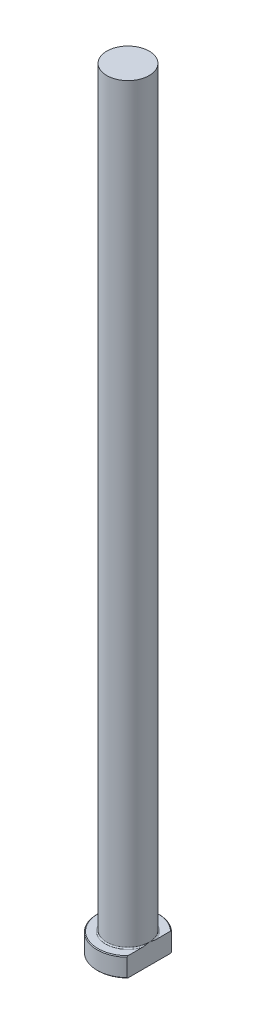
ISO-10303-21;
HEADER;
FILE_DESCRIPTION(('STEP AP214'),'2;1');
FILE_NAME('part.step','',(''),(''),'','','');
FILE_SCHEMA(('AUTOMOTIVE_DESIGN { 1 0 10303 214 1 1 1 1 }'));
ENDSEC;
DATA;
#1=APPLICATION_CONTEXT('core data for automotive mechanical design processes');
#2=APPLICATION_PROTOCOL_DEFINITION('international standard','automotive_design',2000,#1);
#3=PRODUCT_CONTEXT('',#1,'mechanical');
#4=PRODUCT('Part','Part','',(#3));
#5=PRODUCT_RELATED_PRODUCT_CATEGORY('part','',(#4));
#6=PRODUCT_DEFINITION_FORMATION('','',#4);
#7=PRODUCT_DEFINITION_CONTEXT('part definition',#1,'design');
#8=PRODUCT_DEFINITION('design','',#6,#7);
#9=PRODUCT_DEFINITION_SHAPE('','',#8);
#10=(LENGTH_UNIT() NAMED_UNIT(*) SI_UNIT(.MILLI.,.METRE.));
#11=(NAMED_UNIT(*) PLANE_ANGLE_UNIT() SI_UNIT($,.RADIAN.));
#12=(NAMED_UNIT(*) SI_UNIT($,.STERADIAN.) SOLID_ANGLE_UNIT());
#13=UNCERTAINTY_MEASURE_WITH_UNIT(LENGTH_MEASURE(1.E-05),#10,'distance_accuracy_value','');
#14=(GEOMETRIC_REPRESENTATION_CONTEXT(3) GLOBAL_UNCERTAINTY_ASSIGNED_CONTEXT((#13)) GLOBAL_UNIT_ASSIGNED_CONTEXT((#10,
#11,#12)) REPRESENTATION_CONTEXT('',''));
#15=CARTESIAN_POINT('',(0.,0.,0.));
#16=DIRECTION('',(0.,0.,1.));
#17=DIRECTION('',(1.,0.,0.));
#18=AXIS2_PLACEMENT_3D('',#15,#16,#17);
#19=CARTESIAN_POINT('',(0.,0.,0.));
#20=DIRECTION('',(0.,-1.,0.));
#21=DIRECTION('',(0.,0.,-1.));
#22=AXIS2_PLACEMENT_3D('',#19,#20,#21);
#23=PLANE('',#22);
#24=CARTESIAN_POINT('',(0.,0.,0.));
#25=DIRECTION('',(0.,-1.,0.));
#26=DIRECTION('',(0.,0.,-1.));
#27=AXIS2_PLACEMENT_3D('',#24,#25,#26);
#28=CIRCLE('',#27,7.79999999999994);
#29=CARTESIAN_POINT('',(5.49999999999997,0.,5.53082272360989));
#30=VERTEX_POINT('',#29);
#31=CARTESIAN_POINT('',(5.49999999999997,0.,-5.53082272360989));
#32=VERTEX_POINT('',#31);
#33=EDGE_CURVE('E98',#30,#32,#28,.T.);
#34=ORIENTED_EDGE('',*,*,#33,.T.);
#35=DIRECTION('',(0.,0.,1.));
#36=VECTOR('',#35,1.);
#37=CARTESIAN_POINT('',(5.49999999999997,0.,-5.80947501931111));
#38=LINE('',#37,#36);
#39=EDGE_CURVE('E83',#32,#30,#38,.T.);
#40=ORIENTED_EDGE('',*,*,#39,.T.);
#41=EDGE_LOOP('',(#34,#40));
#42=FACE_BOUND('',#41,.T.);
#43=ADVANCED_FACE('F32',(#42),#23,.T.);
#44=CARTESIAN_POINT('',(0.,259.958771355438,0.));
#45=DIRECTION('',(0.,1.,0.));
#46=DIRECTION('',(0.,0.,1.));
#47=AXIS2_PLACEMENT_3D('',#44,#45,#46);
#48=CYLINDRICAL_SURFACE('',#47,7.99999999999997);
#49=CARTESIAN_POINT('',(0.,4.80000000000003,0.));
#50=DIRECTION('',(0.,1.,0.));
#51=DIRECTION('',(0.,0.,1.));
#52=AXIS2_PLACEMENT_3D('',#49,#50,#51);
#53=CIRCLE('',#52,7.99999999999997);
#54=CARTESIAN_POINT('',(5.49999999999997,4.80000000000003,5.80947501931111));
#55=VERTEX_POINT('',#54);
#56=CARTESIAN_POINT('',(5.49999999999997,4.80000000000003,-5.80947501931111));
#57=VERTEX_POINT('',#56);
#58=EDGE_CURVE('E104',#55,#57,#53,.F.);
#59=ORIENTED_EDGE('',*,*,#58,.T.);
#60=DIRECTION('',(0.,-1.,0.));
#61=VECTOR('',#60,1.);
#62=CARTESIAN_POINT('',(5.49999999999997,200.,-5.80947501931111));
#63=LINE('',#62,#61);
#64=CARTESIAN_POINT('',(5.49999999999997,0.200000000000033,-5.80947501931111));
#65=VERTEX_POINT('',#64);
#66=EDGE_CURVE('E183',#57,#65,#63,.T.);
#67=ORIENTED_EDGE('',*,*,#66,.T.);
#68=CARTESIAN_POINT('',(0.,0.200000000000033,0.));
#69=DIRECTION('',(0.,-1.,0.));
#70=DIRECTION('',(0.,0.,-1.));
#71=AXIS2_PLACEMENT_3D('',#68,#69,#70);
#72=CIRCLE('',#71,7.99999999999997);
#73=CARTESIAN_POINT('',(5.49999999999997,0.200000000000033,5.80947501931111));
#74=VERTEX_POINT('',#73);
#75=EDGE_CURVE('E100',#65,#74,#72,.F.);
#76=ORIENTED_EDGE('',*,*,#75,.T.);
#77=DIRECTION('',(0.,-1.,0.));
#78=VECTOR('',#77,1.);
#79=CARTESIAN_POINT('',(5.49999999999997,200.,5.80947501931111));
#80=LINE('',#79,#78);
#81=EDGE_CURVE('E93',#55,#74,#80,.T.);
#82=ORIENTED_EDGE('',*,*,#81,.F.);
#83=EDGE_LOOP('',(#59,#67,#76,#82));
#84=FACE_BOUND('',#83,.T.);
#85=ADVANCED_FACE('F158',(#84),#48,.T.);
#86=CARTESIAN_POINT('',(-7.99999999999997,5.,0.));
#87=DIRECTION('',(0.,1.,0.));
#88=DIRECTION('',(0.,0.,1.));
#89=AXIS2_PLACEMENT_3D('',#86,#87,#88);
#90=PLANE('',#89);
#91=CARTESIAN_POINT('',(0.,5.,0.));
#92=DIRECTION('',(0.,1.,0.));
#93=DIRECTION('',(0.,0.,1.));
#94=AXIS2_PLACEMENT_3D('',#91,#92,#93);
#95=CIRCLE('',#94,7.79999999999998);
#96=CARTESIAN_POINT('',(5.49999999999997,5.,-5.53082272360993));
#97=VERTEX_POINT('',#96);
#98=CARTESIAN_POINT('',(5.49999999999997,5.,5.53082272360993));
#99=VERTEX_POINT('',#98);
#100=EDGE_CURVE('E178',#97,#99,#95,.T.);
#101=ORIENTED_EDGE('',*,*,#100,.T.);
#102=DIRECTION('',(0.,0.,-1.));
#103=VECTOR('',#102,1.);
#104=CARTESIAN_POINT('',(5.49999999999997,5.,0.));
#105=LINE('',#104,#103);
#106=CARTESIAN_POINT('',(5.49999999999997,4.99999999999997,1.84119526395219));
#107=VERTEX_POINT('',#106);
#108=EDGE_CURVE('E57',#99,#107,#105,.T.);
#109=ORIENTED_EDGE('',*,*,#108,.T.);
#110=CARTESIAN_POINT('',(0.,5.,0.));
#111=DIRECTION('',(0.,1.,0.));
#112=DIRECTION('',(0.,0.,1.));
#113=AXIS2_PLACEMENT_3D('',#110,#111,#112);
#114=CIRCLE('',#113,5.79999999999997);
#115=CARTESIAN_POINT('',(5.49999999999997,4.99999999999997,-1.84119526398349));
#116=VERTEX_POINT('',#115);
#117=EDGE_CURVE('E107',#107,#116,#114,.F.);
#118=ORIENTED_EDGE('',*,*,#117,.T.);
#119=EDGE_CURVE('E136',#116,#97,#105,.T.);
#120=ORIENTED_EDGE('',*,*,#119,.T.);
#121=EDGE_LOOP('',(#101,#109,#118,#120));
#122=FACE_BOUND('',#121,.T.);
#123=ADVANCED_FACE('F147',(#122),#90,.T.);
#124=CARTESIAN_POINT('',(0.,5.,0.));
#125=DIRECTION('',(0.,-1.,0.));
#126=DIRECTION('',(0.,0.,-1.));
#127=AXIS2_PLACEMENT_3D('',#124,#125,#126);
#128=CONICAL_SURFACE('',#127,7.79999999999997,0.785398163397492);
#129=ORIENTED_EDGE('',*,*,#58,.F.);
#130=CARTESIAN_POINT('',(5.49999999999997,-1.11515403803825,12.7820777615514));
#131=CARTESIAN_POINT('',(5.49999999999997,-0.94151788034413,12.5930460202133));
#132=CARTESIAN_POINT('',(5.49999999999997,-0.768204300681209,12.4037180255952));
#133=CARTESIAN_POINT('',(5.49999999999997,-0.422318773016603,12.0243831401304));
#134=CARTESIAN_POINT('',(5.49999999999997,-0.249746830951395,11.8343762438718));
#135=CARTESIAN_POINT('',(5.49999999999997,0.266785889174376,11.2631256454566));
#136=CARTESIAN_POINT('',(5.49999999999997,0.609484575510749,10.8807378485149));
#137=CARTESIAN_POINT('',(5.49999999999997,1.29256544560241,10.1095655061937));
#138=CARTESIAN_POINT('',(5.49999999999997,1.63291928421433,9.72075580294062));
#139=CARTESIAN_POINT('',(5.49999999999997,2.30738282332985,8.9378216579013));
#140=CARTESIAN_POINT('',(5.49999999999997,2.64149328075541,8.54369787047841));
#141=CARTESIAN_POINT('',(5.49999999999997,3.24251408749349,7.81851180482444));
#142=CARTESIAN_POINT('',(5.49999999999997,3.51085021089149,7.48863708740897));
#143=CARTESIAN_POINT('',(5.49999999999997,3.90712731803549,6.98880713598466));
#144=CARTESIAN_POINT('',(5.49999999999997,4.03820076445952,6.82133570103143));
#145=CARTESIAN_POINT('',(5.49999999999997,4.29784042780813,6.48446279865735));
#146=CARTESIAN_POINT('',(5.49999999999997,4.42640670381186,6.31506137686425));
#147=CARTESIAN_POINT('',(5.49999999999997,4.68038690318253,5.97419641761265));
#148=CARTESIAN_POINT('',(5.49999999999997,4.80580413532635,5.80273535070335));
#149=CARTESIAN_POINT('',(5.49999999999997,5.05297330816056,5.4571974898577));
#150=CARTESIAN_POINT('',(5.49999999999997,5.17472543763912,5.2831208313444));
#151=CARTESIAN_POINT('',(5.49999999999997,5.41367984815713,4.93196486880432));
#152=CARTESIAN_POINT('',(5.49999999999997,5.53088395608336,4.75488681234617));
#153=CARTESIAN_POINT('',(5.49999999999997,5.7596825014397,4.3971560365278));
#154=CARTESIAN_POINT('',(5.49999999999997,5.87127761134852,4.21650374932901));
#155=CARTESIAN_POINT('',(5.49999999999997,6.08629942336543,3.85292662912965));
#156=CARTESIAN_POINT('',(5.49999999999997,6.18979942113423,3.67004539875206));
#157=CARTESIAN_POINT('',(5.49999999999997,6.38808999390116,3.29955746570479));
#158=CARTESIAN_POINT('',(5.49999999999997,6.48287965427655,3.11195026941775));
#159=CARTESIAN_POINT('',(5.49999999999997,6.66127167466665,2.7316929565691));
#160=CARTESIAN_POINT('',(5.49999999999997,6.7448862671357,2.53904863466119));
#161=CARTESIAN_POINT('',(5.49999999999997,6.89808375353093,2.14822839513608));
#162=CARTESIAN_POINT('',(5.49999999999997,6.96767069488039,1.95005409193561));
#163=CARTESIAN_POINT('',(5.49999999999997,7.07670147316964,1.59030424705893));
#164=CARTESIAN_POINT('',(5.49999999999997,7.11940527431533,1.42972239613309));
#165=CARTESIAN_POINT('',(5.49999999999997,7.19217730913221,1.10570020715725));
#166=CARTESIAN_POINT('',(5.49999999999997,7.22224726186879,0.94226026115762));
#167=CARTESIAN_POINT('',(5.49999999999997,7.26823317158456,0.613832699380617));
#168=CARTESIAN_POINT('',(5.49999999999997,7.28418798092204,0.448850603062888));
#169=CARTESIAN_POINT('',(5.49999999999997,7.30121051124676,0.118111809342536));
#170=CARTESIAN_POINT('',(5.49999999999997,7.30227865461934,-0.0476448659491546));
#171=CARTESIAN_POINT('',(5.49999999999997,7.28946437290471,-0.378643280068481));
#172=CARTESIAN_POINT('',(5.49999999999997,7.27557532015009,-0.54388475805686));
#173=CARTESIAN_POINT('',(5.49999999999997,7.23360586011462,-0.872541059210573));
#174=CARTESIAN_POINT('',(5.49999999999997,7.20552424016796,-1.03595572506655));
#175=CARTESIAN_POINT('',(5.49999999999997,7.13645491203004,-1.36050703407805));
#176=CARTESIAN_POINT('',(5.49999999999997,7.09542895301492,-1.52163542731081));
#177=CARTESIAN_POINT('',(5.49999999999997,7.00220098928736,-1.84058362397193));
#178=CARTESIAN_POINT('',(5.49999999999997,6.94999898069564,-1.99840342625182));
#179=CARTESIAN_POINT('',(5.49999999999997,6.82412729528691,-2.34351289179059));
#180=CARTESIAN_POINT('',(5.49999999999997,6.74825204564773,-2.52999311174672));
#181=CARTESIAN_POINT('',(5.49999999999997,6.58537605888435,-2.89807095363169));
#182=CARTESIAN_POINT('',(5.49999999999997,6.4983700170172,-3.07966619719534));
#183=CARTESIAN_POINT('',(5.49999999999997,6.31536700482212,-3.43865575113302));
#184=CARTESIAN_POINT('',(5.49999999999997,6.21935375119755,-3.61604169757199));
#185=CARTESIAN_POINT('',(5.49999999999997,6.02029718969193,-3.96676299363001));
#186=CARTESIAN_POINT('',(5.49999999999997,5.91725492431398,-4.14009893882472));
#187=CARTESIAN_POINT('',(5.49999999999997,5.70428964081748,-4.4852832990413));
#188=CARTESIAN_POINT('',(5.49999999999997,5.59430018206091,-4.65709053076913));
#189=CARTESIAN_POINT('',(5.49999999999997,5.3696632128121,-4.99762683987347));
#190=CARTESIAN_POINT('',(5.49999999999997,5.25501557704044,-5.16635583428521));
#191=CARTESIAN_POINT('',(5.49999999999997,5.02205528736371,-5.50098485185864));
#192=CARTESIAN_POINT('',(5.49999999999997,4.90374674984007,-5.66688774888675));
#193=CARTESIAN_POINT('',(5.49999999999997,4.66400808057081,-5.9964258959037));
#194=CARTESIAN_POINT('',(5.49999999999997,4.54257783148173,-6.16006106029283));
#195=CARTESIAN_POINT('',(5.49999999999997,4.20154795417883,-6.61207712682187));
#196=CARTESIAN_POINT('',(5.49999999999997,3.97915323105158,-6.89834873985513));
#197=CARTESIAN_POINT('',(5.49999999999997,3.52835863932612,-7.46612572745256));
#198=CARTESIAN_POINT('',(5.49999999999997,3.29995838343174,-7.7476307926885));
#199=CARTESIAN_POINT('',(5.49999999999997,2.83846100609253,-8.30706072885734));
#200=CARTESIAN_POINT('',(5.49999999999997,2.6053609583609,-8.58498318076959));
#201=CARTESIAN_POINT('',(5.49999999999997,2.13563301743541,-9.13783071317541));
#202=CARTESIAN_POINT('',(5.49999999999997,1.89900507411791,-9.41275575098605));
#203=CARTESIAN_POINT('',(5.49999999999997,1.43345389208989,-9.94811769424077));
#204=CARTESIAN_POINT('',(5.49999999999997,1.2046506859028,-10.2086591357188));
#205=CARTESIAN_POINT('',(5.49999999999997,0.744976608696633,-10.7279148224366));
#206=CARTESIAN_POINT('',(5.49999999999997,0.514105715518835,-10.9866290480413));
#207=CARTESIAN_POINT('',(5.49999999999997,0.0509694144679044,-11.5022006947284));
#208=CARTESIAN_POINT('',(5.49999999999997,-0.181293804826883,-11.7590600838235));
#209=CARTESIAN_POINT('',(5.49999999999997,-0.647231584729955,-12.2714820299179));
#210=CARTESIAN_POINT('',(5.49999999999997,-0.880906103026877,-12.5270446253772));
#211=CARTESIAN_POINT('',(5.49999999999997,-1.11515403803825,-12.7820777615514));
#212=B_SPLINE_CURVE_WITH_KNOTS('',3,(#130,#131,#132,#133,#134,#135,#136,#137,#138,#139,#140,
#141,#142,#143,#144,#145,#146,#147,#148,#149,#150,#151,#152,#153,#154,#155,#156,#157,#158,#159,
#160,#161,#162,#163,#164,#165,#166,#167,#168,#169,#170,#171,#172,#173,#174,#175,#176,#177,#178,
#179,#180,#181,#182,#183,#184,#185,#186,#187,#188,#189,#190,#191,#192,#193,#194,#195,#196,#197,
#198,#199,#200,#201,#202,#203,#204,#205,#206,#207,#208,#209,#210,#211),.UNSPECIFIED.,.F.,.F.,(4,
2,2,2,2,2,2,2,2,2,2,2,2,2,2,2,2,2,2,2,2,2,2,2,2,2,2,2,2,2,2,2,2,2,2,2,2,2,2,2,4),(0.,
0.770026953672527,1.54006005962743,3.080476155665,4.63063153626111,6.18059774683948,
7.45618053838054,8.09416066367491,8.73212573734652,9.36938977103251,10.006620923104,
10.6435933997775,11.2804893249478,11.9107163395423,12.5410094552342,13.1706068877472,
13.800022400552,14.2980757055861,14.7960612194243,15.2926717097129,15.7892681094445,
16.2860846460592,16.782943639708,17.2812848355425,17.7796262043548,18.3831348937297,
18.9869322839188,19.5918430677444,20.1966643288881,20.8085675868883,21.4204873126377,
22.031742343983,22.6430203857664,23.7304168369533,24.8178835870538,25.9060497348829,
26.99423135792,28.0344561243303,29.0746920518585,30.1135832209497,31.1524433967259),.UNSPECIFIED.);
#213=EDGE_CURVE('E135',#55,#99,#212,.T.);
#214=ORIENTED_EDGE('',*,*,#213,.T.);
#215=ORIENTED_EDGE('',*,*,#100,.F.);
#216=EDGE_CURVE('E127',#97,#57,#212,.T.);
#217=ORIENTED_EDGE('',*,*,#216,.T.);
#218=EDGE_LOOP('',(#129,#214,#215,#217));
#219=FACE_BOUND('',#218,.T.);
#220=ADVANCED_FACE('F143',(#219),#128,.T.);
#221=CARTESIAN_POINT('',(0.,0.200000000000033,0.));
#222=DIRECTION('',(0.,1.,0.));
#223=DIRECTION('',(0.,0.,1.));
#224=AXIS2_PLACEMENT_3D('',#221,#222,#223);
#225=CONICAL_SURFACE('',#224,7.99999999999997,0.785398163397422);
#226=ORIENTED_EDGE('',*,*,#75,.F.);
#227=CARTESIAN_POINT('',(5.49999999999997,6.11515403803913,-12.7820777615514));
#228=CARTESIAN_POINT('',(5.49999999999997,5.941517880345,-12.5930460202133));
#229=CARTESIAN_POINT('',(5.49999999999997,5.76820430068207,-12.4037180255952));
#230=CARTESIAN_POINT('',(5.49999999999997,5.42231877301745,-12.0243831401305));
#231=CARTESIAN_POINT('',(5.49999999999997,5.24974683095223,-11.8343762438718));
#232=CARTESIAN_POINT('',(5.49999999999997,4.73321411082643,-11.2631256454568));
#233=CARTESIAN_POINT('',(5.49999999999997,4.39051542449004,-10.8807378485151));
#234=CARTESIAN_POINT('',(5.49999999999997,3.70743455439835,-10.109565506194));
#235=CARTESIAN_POINT('',(5.49999999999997,3.36708071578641,-9.7207558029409));
#236=CARTESIAN_POINT('',(5.49999999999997,2.69261717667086,-8.93782165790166));
#237=CARTESIAN_POINT('',(5.49999999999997,2.35850671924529,-8.54369787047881));
#238=CARTESIAN_POINT('',(5.49999999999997,1.75748591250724,-7.81851180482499));
#239=CARTESIAN_POINT('',(5.49999999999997,1.48914978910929,-7.48863708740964));
#240=CARTESIAN_POINT('',(5.49999999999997,1.09287268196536,-6.9888071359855));
#241=CARTESIAN_POINT('',(5.49999999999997,0.961799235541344,-6.82133570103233));
#242=CARTESIAN_POINT('',(5.49999999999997,0.702159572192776,-6.48446279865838));
#243=CARTESIAN_POINT('',(5.49999999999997,0.573593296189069,-6.31506137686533));
#244=CARTESIAN_POINT('',(5.49999999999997,0.319613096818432,-5.97419641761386));
#245=CARTESIAN_POINT('',(5.49999999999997,0.194195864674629,-5.80273535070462));
#246=CARTESIAN_POINT('',(5.49999999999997,-0.0529733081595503,-5.4571974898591));
#247=CARTESIAN_POINT('',(5.49999999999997,-0.174725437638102,-5.28312083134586));
#248=CARTESIAN_POINT('',(5.49999999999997,-0.413679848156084,-4.93196486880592));
#249=CARTESIAN_POINT('',(5.49999999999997,-0.530883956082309,-4.75488681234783));
#250=CARTESIAN_POINT('',(5.49999999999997,-0.759682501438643,-4.39715603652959));
#251=CARTESIAN_POINT('',(5.49999999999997,-0.871277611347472,-4.21650374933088));
#252=CARTESIAN_POINT('',(5.49999999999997,-1.08629942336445,-3.85292662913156));
#253=CARTESIAN_POINT('',(5.49999999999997,-1.18979942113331,-3.67004539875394));
#254=CARTESIAN_POINT('',(5.49999999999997,-1.38808999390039,-3.2995574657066));
#255=CARTESIAN_POINT('',(5.49999999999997,-1.48287965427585,-3.11195026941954));
#256=CARTESIAN_POINT('',(5.49999999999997,-1.66127167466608,-2.73169295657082));
#257=CARTESIAN_POINT('',(5.49999999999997,-1.7448862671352,-2.53904863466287));
#258=CARTESIAN_POINT('',(5.49999999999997,-1.89808375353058,-2.14822839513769));
#259=CARTESIAN_POINT('',(5.49999999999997,-1.96767069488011,-1.95005409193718));
#260=CARTESIAN_POINT('',(5.49999999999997,-2.07670147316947,-1.59030424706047));
#261=CARTESIAN_POINT('',(5.49999999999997,-2.11940527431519,-1.42972239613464));
#262=CARTESIAN_POINT('',(5.49999999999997,-2.19217730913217,-1.10570020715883));
#263=CARTESIAN_POINT('',(5.49999999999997,-2.2222472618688,-0.942260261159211));
#264=CARTESIAN_POINT('',(5.49999999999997,-2.26823317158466,-0.613832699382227));
#265=CARTESIAN_POINT('',(5.49999999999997,-2.28418798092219,-0.448850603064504));
#266=CARTESIAN_POINT('',(5.49999999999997,-2.30121051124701,-0.118111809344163));
#267=CARTESIAN_POINT('',(5.49999999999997,-2.30227865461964,0.0476448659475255));
#268=CARTESIAN_POINT('',(5.49999999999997,-2.28946437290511,0.378643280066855));
#269=CARTESIAN_POINT('',(5.49999999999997,-2.27557532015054,0.54388475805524));
#270=CARTESIAN_POINT('',(5.49999999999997,-2.23360586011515,0.872541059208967));
#271=CARTESIAN_POINT('',(5.49999999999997,-2.20552424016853,1.03595572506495));
#272=CARTESIAN_POINT('',(5.49999999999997,-2.13645491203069,1.36050703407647));
#273=CARTESIAN_POINT('',(5.49999999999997,-2.0954289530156,1.52163542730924));
#274=CARTESIAN_POINT('',(5.49999999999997,-2.0022009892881,1.84058362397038));
#275=CARTESIAN_POINT('',(5.49999999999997,-1.94999898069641,1.99840342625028));
#276=CARTESIAN_POINT('',(5.49999999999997,-1.82412729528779,2.34351289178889));
#277=CARTESIAN_POINT('',(5.49999999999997,-1.74825204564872,2.52999311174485));
#278=CARTESIAN_POINT('',(5.49999999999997,-1.58537605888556,2.8980709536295));
#279=CARTESIAN_POINT('',(5.49999999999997,-1.49837001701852,3.07966619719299));
#280=CARTESIAN_POINT('',(5.49999999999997,-1.31536700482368,3.43865575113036));
#281=CARTESIAN_POINT('',(5.49999999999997,-1.21935375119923,3.61604169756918));
#282=CARTESIAN_POINT('',(5.49999999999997,-1.02029718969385,3.9667629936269));
#283=CARTESIAN_POINT('',(5.49999999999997,-0.917254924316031,4.14009893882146));
#284=CARTESIAN_POINT('',(5.49999999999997,-0.704289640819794,4.48528329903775));
#285=CARTESIAN_POINT('',(5.49999999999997,-0.594300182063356,4.65709053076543));
#286=CARTESIAN_POINT('',(5.49999999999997,-0.369663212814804,4.99762683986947));
#287=CARTESIAN_POINT('',(5.49999999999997,-0.255015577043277,5.16635583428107));
#288=CARTESIAN_POINT('',(5.49999999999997,-0.0220552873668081,5.50098485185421));
#289=CARTESIAN_POINT('',(5.49999999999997,0.0962532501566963,5.66688774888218));
#290=CARTESIAN_POINT('',(5.49999999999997,0.335991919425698,5.99642589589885));
#291=CARTESIAN_POINT('',(5.49999999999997,0.457422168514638,6.16006106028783));
#292=CARTESIAN_POINT('',(5.49999999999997,0.798452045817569,6.61207712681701));
#293=CARTESIAN_POINT('',(5.49999999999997,1.02084676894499,6.89834873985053));
#294=CARTESIAN_POINT('',(5.49999999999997,1.47164136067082,7.46612572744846));
#295=CARTESIAN_POINT('',(5.49999999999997,1.70004161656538,7.74763079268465));
#296=CARTESIAN_POINT('',(5.49999999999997,2.16153899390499,8.30706072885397));
#297=CARTESIAN_POINT('',(5.49999999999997,2.39463904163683,8.58498318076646));
#298=CARTESIAN_POINT('',(5.49999999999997,2.86436698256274,9.13783071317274));
#299=CARTESIAN_POINT('',(5.49999999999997,3.10099492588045,9.41275575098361));
#300=CARTESIAN_POINT('',(5.49999999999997,3.56654610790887,9.94811769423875));
#301=CARTESIAN_POINT('',(5.49999999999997,3.79534931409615,10.208659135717));
#302=CARTESIAN_POINT('',(5.49999999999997,4.2550233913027,10.7279148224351));
#303=CARTESIAN_POINT('',(5.49999999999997,4.48589428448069,10.9866290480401));
#304=CARTESIAN_POINT('',(5.49999999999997,4.949030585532,11.5022006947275));
#305=CARTESIAN_POINT('',(5.49999999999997,5.18129380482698,11.7590600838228));
#306=CARTESIAN_POINT('',(5.49999999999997,5.64723158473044,12.2714820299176));
#307=CARTESIAN_POINT('',(5.49999999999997,5.88090610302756,12.527044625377));
#308=CARTESIAN_POINT('',(5.49999999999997,6.11515403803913,12.7820777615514));
#309=B_SPLINE_CURVE_WITH_KNOTS('',3,(#227,#228,#229,#230,#231,#232,#233,#234,#235,#236,#237,
#238,#239,#240,#241,#242,#243,#244,#245,#246,#247,#248,#249,#250,#251,#252,#253,#254,#255,#256,
#257,#258,#259,#260,#261,#262,#263,#264,#265,#266,#267,#268,#269,#270,#271,#272,#273,#274,#275,
#276,#277,#278,#279,#280,#281,#282,#283,#284,#285,#286,#287,#288,#289,#290,#291,#292,#293,#294,
#295,#296,#297,#298,#299,#300,#301,#302,#303,#304,#305,#306,#307,#308),.UNSPECIFIED.,.F.,.F.,(4,
2,2,2,2,2,2,2,2,2,2,2,2,2,2,2,2,2,2,2,2,2,2,2,2,2,2,2,2,2,2,2,2,2,2,2,2,2,2,2,4),(0.,
0.770026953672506,1.54006005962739,3.08047615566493,4.63063153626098,6.18059774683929,
7.45618053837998,8.09416066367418,8.7321257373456,9.36938977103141,10.0066209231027,
10.6435933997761,11.2804893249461,11.9107163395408,12.5410094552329,13.1706068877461,
13.8000224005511,14.2980757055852,14.7960612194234,15.292671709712,15.7892681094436,
16.2860846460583,16.7829436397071,17.2812848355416,17.7796262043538,18.3831348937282,
18.9869322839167,19.5918430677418,20.1966643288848,20.8085675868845,21.4204873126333,
22.031742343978,22.6430203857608,23.7304168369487,24.8178835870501,25.9060497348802,
26.9942313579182,28.0344561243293,29.0746920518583,30.1135832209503,31.1524433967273),.UNSPECIFIED.);
#310=EDGE_CURVE('E86',#65,#32,#309,.T.);
#311=ORIENTED_EDGE('',*,*,#310,.T.);
#312=ORIENTED_EDGE('',*,*,#33,.F.);
#313=EDGE_CURVE('E89',#30,#74,#309,.T.);
#314=ORIENTED_EDGE('',*,*,#313,.T.);
#315=EDGE_LOOP('',(#226,#311,#312,#314));
#316=FACE_BOUND('',#315,.T.);
#317=ADVANCED_FACE('F97',(#316),#225,.T.);
#318=CARTESIAN_POINT('',(0.,5.29999999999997,0.));
#319=DIRECTION('',(0.,1.,0.));
#320=DIRECTION('',(0.,0.,1.));
#321=AXIS2_PLACEMENT_3D('',#318,#319,#320);
#322=TOROIDAL_SURFACE('',#321,5.79999999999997,0.3);
#323=CARTESIAN_POINT('',(5.49999999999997,5.29999999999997,0.));
#324=CARTESIAN_POINT('',(5.49999999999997,5.30000062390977,1.37321730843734E-10));
#325=CARTESIAN_POINT('',(5.49999999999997,5.30000124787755,-2.69376376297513E-07));
#326=CARTESIAN_POINT('',(5.49999999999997,5.30000240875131,-9.99151691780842E-07));
#327=CARTESIAN_POINT('',(5.49999999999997,5.30000292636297,-1.47834826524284E-06));
#328=CARTESIAN_POINT('',(5.49999999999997,5.30000401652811,-2.63038637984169E-06));
#329=CARTESIAN_POINT('',(5.49999999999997,5.3000045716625,-3.32194614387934E-06));
#330=CARTESIAN_POINT('',(5.49999999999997,5.30000555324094,-4.74435536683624E-06));
#331=CARTESIAN_POINT('',(5.49999999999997,5.30000598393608,-5.47253605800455E-06));
#332=CARTESIAN_POINT('',(5.49999999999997,5.30000761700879,-8.33560288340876E-06));
#333=CARTESIAN_POINT('',(5.49999999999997,5.30000873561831,-1.05221151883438E-05));
#334=CARTESIAN_POINT('',(5.49999999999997,5.30001054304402,-1.48184286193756E-05));
#335=CARTESIAN_POINT('',(5.49999999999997,5.30001126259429,-1.69157853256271E-05));
#336=CARTESIAN_POINT('',(5.49999999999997,5.30001433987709,-2.59119235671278E-05));
#337=CARTESIAN_POINT('',(5.49999999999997,5.30001667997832,-3.28197570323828E-05));
#338=CARTESIAN_POINT('',(5.49999999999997,5.30002006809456,-4.57841698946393E-05));
#339=CARTESIAN_POINT('',(5.49999999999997,5.30002126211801,-5.18021293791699E-05));
#340=CARTESIAN_POINT('',(5.49999999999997,5.30003004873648,-9.68722229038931E-05));
#341=CARTESIAN_POINT('',(5.49999999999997,5.30003680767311,-0.000136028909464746));
#342=CARTESIAN_POINT('',(5.49999999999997,5.30006639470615,-0.000291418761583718));
#343=CARTESIAN_POINT('',(5.49999999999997,5.30009452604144,-0.000406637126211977));
#344=CARTESIAN_POINT('',(5.49999999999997,5.30020462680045,-0.000864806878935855));
#345=CARTESIAN_POINT('',(5.49999999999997,5.30028324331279,-0.00120829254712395));
#346=CARTESIAN_POINT('',(5.49999999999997,5.3005992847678,-0.00257937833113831));
#347=CARTESIAN_POINT('',(5.49999999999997,5.300840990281,-0.00360627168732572));
#348=CARTESIAN_POINT('',(5.49999999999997,5.30184970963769,-0.00790277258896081));
#349=CARTESIAN_POINT('',(5.49999999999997,5.30261131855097,-0.0111732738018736));
#350=CARTESIAN_POINT('',(5.49999999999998,5.30969442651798,-0.0415753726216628));
#351=CARTESIAN_POINT('',(5.49999999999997,5.31603915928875,-0.0687032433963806));
#352=CARTESIAN_POINT('',(5.49999999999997,5.32843561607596,-0.121865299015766));
#353=CARTESIAN_POINT('',(5.49999999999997,5.33448878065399,-0.147899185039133));
#354=CARTESIAN_POINT('',(5.49999999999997,5.34733836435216,-0.203330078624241));
#355=CARTESIAN_POINT('',(5.49999999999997,5.35413005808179,-0.232728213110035));
#356=CARTESIAN_POINT('',(5.49999999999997,5.36771480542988,-0.29186839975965));
#357=CARTESIAN_POINT('',(5.49999999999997,5.37450703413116,-0.321610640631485));
#358=CARTESIAN_POINT('',(5.49999999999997,5.3907398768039,-0.393246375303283));
#359=CARTESIAN_POINT('',(5.49999999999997,5.40013144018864,-0.435151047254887));
#360=CARTESIAN_POINT('',(5.49999999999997,5.41839331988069,-0.517899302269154));
#361=CARTESIAN_POINT('',(5.49999999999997,5.42727085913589,-0.558741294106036));
#362=CARTESIAN_POINT('',(5.49999999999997,5.45304047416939,-0.679649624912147));
#363=CARTESIAN_POINT('',(5.49999999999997,5.46946475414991,-0.759817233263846));
#364=CARTESIAN_POINT('',(5.49999999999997,5.50059525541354,-0.921248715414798));
#365=CARTESIAN_POINT('',(5.49999999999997,5.5152844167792,-1.00251591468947));
#366=CARTESIAN_POINT('',(5.49999999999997,5.54326935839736,-1.17291320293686));
#367=CARTESIAN_POINT('',(5.49999999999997,5.55631639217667,-1.2620853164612));
#368=CARTESIAN_POINT('',(5.49999999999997,5.57807460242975,-1.4407267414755));
#369=CARTESIAN_POINT('',(5.49999999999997,5.5867974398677,-1.53019459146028));
#370=CARTESIAN_POINT('',(5.49999999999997,5.59813646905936,-1.70678130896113));
#371=CARTESIAN_POINT('',(5.49999999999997,5.60093453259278,-1.79388646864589));
#372=CARTESIAN_POINT('',(5.49999999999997,5.59913730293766,-1.92371114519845));
#373=CARTESIAN_POINT('',(5.49999999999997,5.59757869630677,-1.96647130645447));
#374=CARTESIAN_POINT('',(5.49999999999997,5.59207086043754,-2.0518267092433));
#375=CARTESIAN_POINT('',(5.49999999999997,5.58812304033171,-2.09442203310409));
#376=CARTESIAN_POINT('',(5.49999999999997,5.57845042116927,-2.16952357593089));
#377=CARTESIAN_POINT('',(5.49999999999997,5.57333912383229,-2.20210765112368));
#378=CARTESIAN_POINT('',(5.49999999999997,5.56085936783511,-2.26696451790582));
#379=CARTESIAN_POINT('',(5.49999999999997,5.55348387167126,-2.29923601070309));
#380=CARTESIAN_POINT('',(5.49999999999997,5.53578949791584,-2.36314331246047));
#381=CARTESIAN_POINT('',(5.49999999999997,5.52545654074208,-2.39477528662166));
#382=CARTESIAN_POINT('',(5.49999999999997,5.50076223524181,-2.45658585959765));
#383=CARTESIAN_POINT('',(5.49999999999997,5.48639841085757,-2.48676355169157));
#384=CARTESIAN_POINT('',(5.49999999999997,5.45845930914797,-2.53258359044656));
#385=CARTESIAN_POINT('',(5.49999999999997,5.4467285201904,-2.54933279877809));
#386=CARTESIAN_POINT('',(5.49999999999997,5.42036237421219,-2.58032609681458));
#387=CARTESIAN_POINT('',(5.49999999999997,5.40575448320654,-2.59459164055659));
#388=CARTESIAN_POINT('',(5.49999999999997,5.38269146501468,-2.61139952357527));
#389=CARTESIAN_POINT('',(5.49999999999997,5.37567288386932,-2.6159011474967));
#390=CARTESIAN_POINT('',(5.49999999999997,5.36105421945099,-2.62385691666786));
#391=CARTESIAN_POINT('',(5.49999999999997,5.35345422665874,-2.62731122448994));
#392=CARTESIAN_POINT('',(5.49999999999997,5.33769516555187,-2.63292915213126));
#393=CARTESIAN_POINT('',(5.49999999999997,5.32953131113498,-2.63507966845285));
#394=CARTESIAN_POINT('',(5.49999999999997,5.31294528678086,-2.63780090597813));
#395=CARTESIAN_POINT('',(5.49999999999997,5.3045234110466,-2.63837336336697));
#396=CARTESIAN_POINT('',(5.49999999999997,5.28851094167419,-2.63789663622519));
#397=CARTESIAN_POINT('',(5.49999999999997,5.2809155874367,-2.63699270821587));
#398=CARTESIAN_POINT('',(5.49999999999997,5.26598512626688,-2.63392394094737));
#399=CARTESIAN_POINT('',(5.49999999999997,5.25865020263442,-2.6317582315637));
#400=CARTESIAN_POINT('',(5.49999999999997,5.24234078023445,-2.62556604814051));
#401=CARTESIAN_POINT('',(5.49999999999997,5.23350275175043,-2.62118324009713));
#402=CARTESIAN_POINT('',(5.49999999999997,5.21664244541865,-2.61106244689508));
#403=CARTESIAN_POINT('',(5.49999999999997,5.20862200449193,-2.60532150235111));
#404=CARTESIAN_POINT('',(5.49999999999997,5.18881724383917,-2.58912168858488));
#405=CARTESIAN_POINT('',(5.49999999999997,5.17766341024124,-2.57789934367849));
#406=CARTESIAN_POINT('',(5.49999999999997,5.15712865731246,-2.55396421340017));
#407=CARTESIAN_POINT('',(5.49999999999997,5.14775124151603,-2.54124856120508));
#408=CARTESIAN_POINT('',(5.49999999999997,5.1219531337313,-2.50201772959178));
#409=CARTESIAN_POINT('',(5.49999999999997,5.10760202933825,-2.47415772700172));
#410=CARTESIAN_POINT('',(5.49999999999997,5.08264412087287,-2.4167036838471));
#411=CARTESIAN_POINT('',(5.49999999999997,5.07206513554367,-2.38709856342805));
#412=CARTESIAN_POINT('',(5.49999999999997,5.04919805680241,-2.31224104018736));
#413=CARTESIAN_POINT('',(5.49999999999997,5.0386368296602,-2.26646729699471));
#414=CARTESIAN_POINT('',(5.49999999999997,5.02182095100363,-2.17406875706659));
#415=CARTESIAN_POINT('',(5.49999999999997,5.01557941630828,-2.12744180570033));
#416=CARTESIAN_POINT('',(5.49999999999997,5.00649716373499,-2.0351579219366));
#417=CARTESIAN_POINT('',(5.49999999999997,5.00356804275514,-1.98950936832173));
#418=CARTESIAN_POINT('',(5.49999999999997,5.00016782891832,-1.8983460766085));
#419=CARTESIAN_POINT('',(5.49999999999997,4.99968533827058,-1.85283170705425));
#420=CARTESIAN_POINT('',(5.49999999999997,5.00090888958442,-1.74240379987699));
#421=CARTESIAN_POINT('',(5.49999999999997,5.00363706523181,-1.67750284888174));
#422=CARTESIAN_POINT('',(5.49999999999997,5.01218141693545,-1.54793822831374));
#423=CARTESIAN_POINT('',(5.49999999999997,5.01799679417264,-1.48327450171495));
#424=CARTESIAN_POINT('',(5.49999999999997,5.03222723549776,-1.35268561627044));
#425=CARTESIAN_POINT('',(5.49999999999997,5.0407007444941,-1.28676695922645));
#426=CARTESIAN_POINT('',(5.49999999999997,5.05968062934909,-1.1550540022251));
#427=CARTESIAN_POINT('',(5.49999999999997,5.07019222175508,-1.08926046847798));
#428=CARTESIAN_POINT('',(5.49999999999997,5.09695256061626,-0.933785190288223));
#429=CARTESIAN_POINT('',(5.49999999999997,5.11388903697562,-0.844222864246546));
#430=CARTESIAN_POINT('',(5.49999999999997,5.14958548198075,-0.666532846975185));
#431=CARTESIAN_POINT('',(5.49999999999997,5.1683224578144,-0.578400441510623));
#432=CARTESIAN_POINT('',(5.49999999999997,5.20478806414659,-0.412629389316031));
#433=CARTESIAN_POINT('',(5.49999999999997,5.22238111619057,-0.334960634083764));
#434=CARTESIAN_POINT('',(5.49999999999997,5.24959866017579,-0.216510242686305));
#435=CARTESIAN_POINT('',(5.49999999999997,5.25904905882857,-0.175687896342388));
#436=CARTESIAN_POINT('',(5.49999999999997,5.27788780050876,-0.0947269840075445));
#437=CARTESIAN_POINT('',(5.49999999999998,5.28727465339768,-0.0545880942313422));
#438=CARTESIAN_POINT('',(5.49999999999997,5.29739035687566,-0.0111657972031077));
#439=CARTESIAN_POINT('',(5.49999999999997,5.29815375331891,-0.00788783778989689));
#440=CARTESIAN_POINT('',(5.49999999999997,5.29916288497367,-0.00358966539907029));
#441=CARTESIAN_POINT('',(5.49999999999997,5.29940322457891,-0.00256856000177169));
#442=CARTESIAN_POINT('',(5.49999999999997,5.2997176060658,-0.00120467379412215));
#443=CARTESIAN_POINT('',(5.49999999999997,5.29979589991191,-0.000862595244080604));
#444=CARTESIAN_POINT('',(5.49999999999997,5.29990561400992,-0.000406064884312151));
#445=CARTESIAN_POINT('',(5.49999999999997,5.2999336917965,-0.000291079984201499));
#446=CARTESIAN_POINT('',(5.49999999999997,5.29996322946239,-0.000135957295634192));
#447=CARTESIAN_POINT('',(5.49999999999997,5.29996998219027,-9.68324215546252E-05));
#448=CARTESIAN_POINT('',(5.49999999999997,5.29997875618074,-5.17949381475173E-05));
#449=CARTESIAN_POINT('',(5.49999999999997,5.29997994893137,-4.57786558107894E-05));
#450=CARTESIAN_POINT('',(5.49999999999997,5.29998333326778,-3.28177654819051E-05));
#451=CARTESIAN_POINT('',(5.49999999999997,5.2999856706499,-2.59116891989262E-05));
#452=CARTESIAN_POINT('',(5.49999999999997,5.29998874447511,-1.69173980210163E-05));
#453=CARTESIAN_POINT('',(5.49999999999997,5.29998946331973,-1.4820166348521E-05));
#454=CARTESIAN_POINT('',(5.49999999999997,5.29999126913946,-1.05239951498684E-05));
#455=CARTESIAN_POINT('',(5.49999999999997,5.29999238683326,-8.33748307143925E-06));
#456=CARTESIAN_POINT('',(5.49999999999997,5.29999401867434,-5.47429219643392E-06));
#457=CARTESIAN_POINT('',(5.49999999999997,5.29999444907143,-4.74604003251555E-06));
#458=CARTESIAN_POINT('',(5.49999999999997,5.29999543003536,-3.32343406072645E-06));
#459=CARTESIAN_POINT('',(5.49999999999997,5.29999598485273,-2.63174656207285E-06));
#460=CARTESIAN_POINT('',(5.49999999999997,5.29999707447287,-1.47941235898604E-06));
#461=CARTESIAN_POINT('',(5.49999999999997,5.29999759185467,-1.00005962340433E-06));
#462=CARTESIAN_POINT('',(5.49999999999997,5.29999875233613,-2.69883386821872E-07));
#463=CARTESIAN_POINT('',(5.49999999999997,5.29999937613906,-1.37310971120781E-10));
#464=CARTESIAN_POINT('',(5.49999999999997,5.29999999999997,0.));
#465=B_SPLINE_CURVE_WITH_KNOTS('',3,(#323,#324,#325,#326,#327,#328,#329,#330,#331,#332,#333,
#334,#335,#336,#337,#338,#339,#340,#341,#342,#343,#344,#345,#346,#347,#348,#349,#350,#351,#352,
#353,#354,#355,#356,#357,#358,#359,#360,#361,#362,#363,#364,#365,#366,#367,#368,#369,#370,#371,
#372,#373,#374,#375,#376,#377,#378,#379,#380,#381,#382,#383,#384,#385,#386,#387,#388,#389,#390,
#391,#392,#393,#394,#395,#396,#397,#398,#399,#400,#401,#402,#403,#404,#405,#406,#407,#408,#409,
#410,#411,#412,#413,#414,#415,#416,#417,#418,#419,#420,#421,#422,#423,#424,#425,#426,#427,#428,
#429,#430,#431,#432,#433,#434,#435,#436,#437,#438,#439,#440,#441,#442,#443,#444,#445,#446,#447,
#448,#449,#450,#451,#452,#453,#454,#455,#456,#457,#458,#459,#460,#461,#462,#463,#464),
.UNSPECIFIED.,.T.,.F.,(4,2,2,2,2,2,2,2,2,2,2,2,2,2,2,2,2,2,2,2,2,2,2,2,2,2,2,2,2,2,2,2,2,2,2,2,
2,2,2,2,2,2,2,2,2,2,2,2,2,2,2,2,2,2,2,2,2,2,2,2,2,2,2,2,2,2,2,2,2,2,4),(0.,1.89759089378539E-06,
4.0217832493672E-06,6.66436842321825E-06,9.20151056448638E-06,1.65449719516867E-05,
2.31908325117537E-05,4.50383514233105E-05,6.34229836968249E-05,0.000182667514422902,
0.000538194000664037,0.00159559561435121,0.00476009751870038,0.0148345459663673,
0.0984122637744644,0.178597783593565,0.269114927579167,0.360638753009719,0.489470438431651,
0.61485697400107,0.860339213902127,1.10806331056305,1.37834904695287,1.64790189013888,
1.90905265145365,2.03736998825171,2.16561171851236,2.26450233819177,2.36370349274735,
2.46338500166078,2.56312787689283,2.62428570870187,2.68488576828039,2.7098322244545,
2.73477480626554,2.75996408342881,2.78512563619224,2.80795720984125,2.8308045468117,
2.86023439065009,2.88972896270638,2.93692759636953,2.98421836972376,3.07771161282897,
3.17188074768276,3.31245630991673,3.45345688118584,3.59059834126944,3.7271003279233,
3.92187072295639,4.11659074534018,4.31593390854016,4.51579419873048,4.78920516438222,
5.05949875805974,5.29840417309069,5.42411083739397,5.54777320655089,5.55787065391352,
5.56101731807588,5.56207038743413,5.56242519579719,5.56254434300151,5.56256272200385,
5.56258456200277,5.56259120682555,5.56259854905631,5.56260108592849,5.56260372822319,
5.56260585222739,5.5626077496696),.UNSPECIFIED.);
#466=CARTESIAN_POINT('',(5.49999999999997,5.29999999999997,0.));
#467=VERTEX_POINT('',#466);
#468=EDGE_CURVE('E11',#116,#467,#465,.T.);
#469=ORIENTED_EDGE('',*,*,#468,.F.);
#470=ORIENTED_EDGE('',*,*,#117,.F.);
#471=CARTESIAN_POINT('',(5.49999999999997,5.29999999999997,0.));
#472=CARTESIAN_POINT('',(5.49999999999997,5.29999937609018,-1.37321567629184E-10));
#473=CARTESIAN_POINT('',(5.49999999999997,5.29999875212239,2.69376376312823E-07));
#474=CARTESIAN_POINT('',(5.49999999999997,5.29999759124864,9.9915169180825E-07));
#475=CARTESIAN_POINT('',(5.49999999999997,5.29999707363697,1.47834826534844E-06));
#476=CARTESIAN_POINT('',(5.49999999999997,5.29999598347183,2.6303863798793E-06));
#477=CARTESIAN_POINT('',(5.49999999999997,5.29999542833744,3.32194614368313E-06));
#478=CARTESIAN_POINT('',(5.49999999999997,5.299994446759,4.74435536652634E-06));
#479=CARTESIAN_POINT('',(5.49999999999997,5.29999401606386,5.47253605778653E-06));
#480=CARTESIAN_POINT('',(5.49999999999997,5.29999238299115,8.33560288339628E-06));
#481=CARTESIAN_POINT('',(5.49999999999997,5.29999126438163,1.05221151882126E-05));
#482=CARTESIAN_POINT('',(5.49999999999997,5.29998945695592,1.48184286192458E-05));
#483=CARTESIAN_POINT('',(5.49999999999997,5.29998873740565,1.69157853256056E-05));
#484=CARTESIAN_POINT('',(5.49999999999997,5.29998566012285,2.59119235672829E-05));
#485=CARTESIAN_POINT('',(5.49999999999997,5.29998332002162,3.28197570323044E-05));
#486=CARTESIAN_POINT('',(5.49999999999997,5.29997993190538,4.57841698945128E-05));
#487=CARTESIAN_POINT('',(5.49999999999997,5.29997873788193,5.18021293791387E-05));
#488=CARTESIAN_POINT('',(5.49999999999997,5.29996995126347,9.68722229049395E-05));
#489=CARTESIAN_POINT('',(5.49999999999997,5.29996319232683,0.000136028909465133));
#490=CARTESIAN_POINT('',(5.49999999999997,5.29993360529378,0.000291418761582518));
#491=CARTESIAN_POINT('',(5.49999999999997,5.2999054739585,0.000406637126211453));
#492=CARTESIAN_POINT('',(5.49999999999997,5.2997953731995,0.000864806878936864));
#493=CARTESIAN_POINT('',(5.49999999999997,5.29971675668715,0.00120829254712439));
#494=CARTESIAN_POINT('',(5.49999999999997,5.29940071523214,0.00257937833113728));
#495=CARTESIAN_POINT('',(5.49999999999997,5.29915900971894,0.00360627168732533));
#496=CARTESIAN_POINT('',(5.49999999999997,5.29815029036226,0.00790277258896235));
#497=CARTESIAN_POINT('',(5.49999999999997,5.29738868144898,0.0111732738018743));
#498=CARTESIAN_POINT('',(5.49999999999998,5.29030557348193,0.0415753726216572));
#499=CARTESIAN_POINT('',(5.49999999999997,5.28396084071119,0.0687032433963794));
#500=CARTESIAN_POINT('',(5.49999999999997,5.27156438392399,0.121865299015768));
#501=CARTESIAN_POINT('',(5.49999999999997,5.26551121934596,0.147899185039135));
#502=CARTESIAN_POINT('',(5.49999999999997,5.25266163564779,0.203330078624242));
#503=CARTESIAN_POINT('',(5.49999999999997,5.24586994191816,0.232728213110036));
#504=CARTESIAN_POINT('',(5.49999999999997,5.23228519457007,0.291868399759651));
#505=CARTESIAN_POINT('',(5.49999999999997,5.22549296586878,0.321610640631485));
#506=CARTESIAN_POINT('',(5.49999999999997,5.20926012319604,0.393246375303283));
#507=CARTESIAN_POINT('',(5.49999999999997,5.1998685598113,0.435151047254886));
#508=CARTESIAN_POINT('',(5.49999999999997,5.18160668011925,0.517899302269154));
#509=CARTESIAN_POINT('',(5.49999999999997,5.17272914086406,0.558741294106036));
#510=CARTESIAN_POINT('',(5.49999999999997,5.14695952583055,0.679649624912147));
#511=CARTESIAN_POINT('',(5.49999999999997,5.13053524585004,0.759817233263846));
#512=CARTESIAN_POINT('',(5.49999999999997,5.09940474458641,0.921248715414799));
#513=CARTESIAN_POINT('',(5.49999999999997,5.08471558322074,1.00251591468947));
#514=CARTESIAN_POINT('',(5.49999999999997,5.05673064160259,1.17291320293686));
#515=CARTESIAN_POINT('',(5.49999999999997,5.04368360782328,1.2620853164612));
#516=CARTESIAN_POINT('',(5.49999999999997,5.0219253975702,1.4407267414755));
#517=CARTESIAN_POINT('',(5.49999999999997,5.01320256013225,1.53019459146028));
#518=CARTESIAN_POINT('',(5.49999999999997,5.00186353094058,1.70678130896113));
#519=CARTESIAN_POINT('',(5.49999999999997,4.99906546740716,1.79388646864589));
#520=CARTESIAN_POINT('',(5.49999999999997,5.00086269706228,1.92371114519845));
#521=CARTESIAN_POINT('',(5.49999999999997,5.00242130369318,1.96647130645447));
#522=CARTESIAN_POINT('',(5.49999999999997,5.00792913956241,2.0518267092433));
#523=CARTESIAN_POINT('',(5.49999999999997,5.01187695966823,2.09442203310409));
#524=CARTESIAN_POINT('',(5.49999999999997,5.02154957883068,2.16952357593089));
#525=CARTESIAN_POINT('',(5.49999999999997,5.02666087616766,2.20210765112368));
#526=CARTESIAN_POINT('',(5.49999999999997,5.03914063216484,2.26696451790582));
#527=CARTESIAN_POINT('',(5.49999999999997,5.04651612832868,2.29923601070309));
#528=CARTESIAN_POINT('',(5.49999999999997,5.0642105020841,2.36314331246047));
#529=CARTESIAN_POINT('',(5.49999999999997,5.07454345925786,2.39477528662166));
#530=CARTESIAN_POINT('',(5.49999999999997,5.09923776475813,2.45658585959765));
#531=CARTESIAN_POINT('',(5.49999999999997,5.11360158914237,2.48676355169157));
#532=CARTESIAN_POINT('',(5.49999999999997,5.14154069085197,2.53258359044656));
#533=CARTESIAN_POINT('',(5.49999999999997,5.15327147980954,2.54933279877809));
#534=CARTESIAN_POINT('',(5.49999999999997,5.17963762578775,2.58032609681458));
#535=CARTESIAN_POINT('',(5.49999999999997,5.1942455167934,2.59459164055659));
#536=CARTESIAN_POINT('',(5.49999999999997,5.21730853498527,2.61139952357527));
#537=CARTESIAN_POINT('',(5.49999999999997,5.22432711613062,2.6159011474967));
#538=CARTESIAN_POINT('',(5.49999999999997,5.23894578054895,2.62385691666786));
#539=CARTESIAN_POINT('',(5.49999999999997,5.2465457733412,2.62731122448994));
#540=CARTESIAN_POINT('',(5.49999999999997,5.26230483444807,2.63292915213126));
#541=CARTESIAN_POINT('',(5.49999999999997,5.27046868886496,2.63507966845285));
#542=CARTESIAN_POINT('',(5.49999999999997,5.28705471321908,2.63780090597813));
#543=CARTESIAN_POINT('',(5.49999999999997,5.29547658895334,2.63837336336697));
#544=CARTESIAN_POINT('',(5.49999999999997,5.31148905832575,2.63789663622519));
#545=CARTESIAN_POINT('',(5.49999999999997,5.31908441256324,2.63699270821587));
#546=CARTESIAN_POINT('',(5.49999999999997,5.33401487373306,2.63392394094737));
#547=CARTESIAN_POINT('',(5.49999999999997,5.34134979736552,2.6317582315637));
#548=CARTESIAN_POINT('',(5.49999999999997,5.35765921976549,2.62556604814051));
#549=CARTESIAN_POINT('',(5.49999999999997,5.36649724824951,2.62118324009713));
#550=CARTESIAN_POINT('',(5.49999999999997,5.38335755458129,2.61106244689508));
#551=CARTESIAN_POINT('',(5.49999999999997,5.39137799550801,2.60532150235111));
#552=CARTESIAN_POINT('',(5.49999999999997,5.41118275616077,2.58912168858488));
#553=CARTESIAN_POINT('',(5.49999999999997,5.4223365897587,2.57789934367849));
#554=CARTESIAN_POINT('',(5.49999999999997,5.44287134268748,2.55396421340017));
#555=CARTESIAN_POINT('',(5.49999999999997,5.45224875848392,2.54124856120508));
#556=CARTESIAN_POINT('',(5.49999999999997,5.47804686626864,2.50201772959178));
#557=CARTESIAN_POINT('',(5.49999999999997,5.4923979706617,2.47415772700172));
#558=CARTESIAN_POINT('',(5.49999999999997,5.51735587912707,2.4167036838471));
#559=CARTESIAN_POINT('',(5.49999999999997,5.52793486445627,2.38709856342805));
#560=CARTESIAN_POINT('',(5.49999999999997,5.55080194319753,2.31224104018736));
#561=CARTESIAN_POINT('',(5.49999999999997,5.56136317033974,2.26646729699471));
#562=CARTESIAN_POINT('',(5.49999999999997,5.57817904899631,2.17406875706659));
#563=CARTESIAN_POINT('',(5.49999999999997,5.58442058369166,2.12744180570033));
#564=CARTESIAN_POINT('',(5.49999999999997,5.59350283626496,2.0351579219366));
#565=CARTESIAN_POINT('',(5.49999999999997,5.59643195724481,1.98950936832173));
#566=CARTESIAN_POINT('',(5.49999999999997,5.59983217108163,1.8983460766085));
#567=CARTESIAN_POINT('',(5.49999999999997,5.60031466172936,1.85283170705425));
#568=CARTESIAN_POINT('',(5.49999999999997,5.59909111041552,1.74240379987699));
#569=CARTESIAN_POINT('',(5.49999999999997,5.59636293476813,1.67750284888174));
#570=CARTESIAN_POINT('',(5.49999999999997,5.5878185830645,1.54793822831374));
#571=CARTESIAN_POINT('',(5.49999999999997,5.5820032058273,1.48327450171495));
#572=CARTESIAN_POINT('',(5.49999999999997,5.56777276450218,1.35268561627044));
#573=CARTESIAN_POINT('',(5.49999999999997,5.55929925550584,1.28676695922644));
#574=CARTESIAN_POINT('',(5.49999999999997,5.54031937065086,1.1550540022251));
#575=CARTESIAN_POINT('',(5.49999999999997,5.52980777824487,1.08926046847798));
#576=CARTESIAN_POINT('',(5.49999999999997,5.50304743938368,0.933785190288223));
#577=CARTESIAN_POINT('',(5.49999999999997,5.48611096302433,0.844222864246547));
#578=CARTESIAN_POINT('',(5.49999999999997,5.45041451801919,0.666532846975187));
#579=CARTESIAN_POINT('',(5.49999999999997,5.43167754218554,0.578400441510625));
#580=CARTESIAN_POINT('',(5.49999999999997,5.39521193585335,0.412629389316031));
#581=CARTESIAN_POINT('',(5.49999999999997,5.37761888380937,0.334960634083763));
#582=CARTESIAN_POINT('',(5.49999999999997,5.35040133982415,0.216510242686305));
#583=CARTESIAN_POINT('',(5.49999999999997,5.34095094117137,0.17568789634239));
#584=CARTESIAN_POINT('',(5.49999999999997,5.32211219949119,0.0947269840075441));
#585=CARTESIAN_POINT('',(5.49999999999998,5.31272534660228,0.0545880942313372));
#586=CARTESIAN_POINT('',(5.49999999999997,5.30260964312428,0.0111657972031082));
#587=CARTESIAN_POINT('',(5.49999999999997,5.30184624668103,0.00788783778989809));
#588=CARTESIAN_POINT('',(5.49999999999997,5.30083711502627,0.00358966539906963));
#589=CARTESIAN_POINT('',(5.49999999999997,5.30059677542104,0.00256856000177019));
#590=CARTESIAN_POINT('',(5.49999999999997,5.30028239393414,0.0012046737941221));
#591=CARTESIAN_POINT('',(5.49999999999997,5.30020410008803,0.000862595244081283));
#592=CARTESIAN_POINT('',(5.49999999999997,5.30009438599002,0.00040606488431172));
#593=CARTESIAN_POINT('',(5.49999999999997,5.30006630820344,0.00029107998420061));
#594=CARTESIAN_POINT('',(5.49999999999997,5.30003677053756,0.000135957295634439));
#595=CARTESIAN_POINT('',(5.49999999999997,5.30003001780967,9.68324215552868E-05));
#596=CARTESIAN_POINT('',(5.49999999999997,5.3000212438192,5.17949381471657E-05));
#597=CARTESIAN_POINT('',(5.49999999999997,5.30002005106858,4.57786558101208E-05));
#598=CARTESIAN_POINT('',(5.49999999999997,5.30001666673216,3.28177654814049E-05));
#599=CARTESIAN_POINT('',(5.49999999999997,5.30001432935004,2.59116891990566E-05));
#600=CARTESIAN_POINT('',(5.49999999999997,5.30001125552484,1.69173980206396E-05));
#601=CARTESIAN_POINT('',(5.49999999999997,5.30001053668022,1.48201663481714E-05));
#602=CARTESIAN_POINT('',(5.49999999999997,5.30000873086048,1.05239951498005E-05));
#603=CARTESIAN_POINT('',(5.49999999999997,5.30000761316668,8.33748307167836E-06));
#604=CARTESIAN_POINT('',(5.49999999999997,5.3000059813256,5.47429219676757E-06));
#605=CARTESIAN_POINT('',(5.49999999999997,5.30000555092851,4.74604003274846E-06));
#606=CARTESIAN_POINT('',(5.49999999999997,5.30000456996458,3.32343406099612E-06));
#607=CARTESIAN_POINT('',(5.49999999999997,5.30000401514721,2.63174656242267E-06));
#608=CARTESIAN_POINT('',(5.49999999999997,5.30000292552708,1.47941235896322E-06));
#609=CARTESIAN_POINT('',(5.49999999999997,5.30000240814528,1.00005962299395E-06));
#610=CARTESIAN_POINT('',(5.49999999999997,5.30000124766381,2.69883386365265E-07));
#611=CARTESIAN_POINT('',(5.49999999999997,5.30000062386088,1.37310807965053E-10));
#612=CARTESIAN_POINT('',(5.49999999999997,5.29999999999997,0.));
#613=B_SPLINE_CURVE_WITH_KNOTS('',3,(#471,#472,#473,#474,#475,#476,#477,#478,#479,#480,#481,
#482,#483,#484,#485,#486,#487,#488,#489,#490,#491,#492,#493,#494,#495,#496,#497,#498,#499,#500,
#501,#502,#503,#504,#505,#506,#507,#508,#509,#510,#511,#512,#513,#514,#515,#516,#517,#518,#519,
#520,#521,#522,#523,#524,#525,#526,#527,#528,#529,#530,#531,#532,#533,#534,#535,#536,#537,#538,
#539,#540,#541,#542,#543,#544,#545,#546,#547,#548,#549,#550,#551,#552,#553,#554,#555,#556,#557,
#558,#559,#560,#561,#562,#563,#564,#565,#566,#567,#568,#569,#570,#571,#572,#573,#574,#575,#576,
#577,#578,#579,#580,#581,#582,#583,#584,#585,#586,#587,#588,#589,#590,#591,#592,#593,#594,#595,
#596,#597,#598,#599,#600,#601,#602,#603,#604,#605,#606,#607,#608,#609,#610,#611,#612),
.UNSPECIFIED.,.T.,.F.,(4,2,2,2,2,2,2,2,2,2,2,2,2,2,2,2,2,2,2,2,2,2,2,2,2,2,2,2,2,2,2,2,2,2,2,2,
2,2,2,2,2,2,2,2,2,2,2,2,2,2,2,2,2,2,2,2,2,2,2,2,2,2,2,2,2,2,2,2,2,2,4),(0.,1.89759089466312E-06,
4.02178324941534E-06,6.66436842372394E-06,9.20151056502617E-06,1.65449719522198E-05,
2.31908325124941E-05,4.50383514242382E-05,6.3422983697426E-05,0.000182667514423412,
0.000538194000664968,0.00159559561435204,0.00476009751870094,0.0148345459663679,
0.0984122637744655,0.178597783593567,0.269114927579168,0.36063875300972,0.489470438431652,
0.61485697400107,0.860339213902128,1.10806331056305,1.37834904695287,1.64790189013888,
1.90905265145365,2.03736998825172,2.16561171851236,2.26450233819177,2.36370349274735,
2.46338500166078,2.56312787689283,2.62428570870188,2.68488576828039,2.7098322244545,
2.73477480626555,2.75996408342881,2.78512563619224,2.80795720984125,2.8308045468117,
2.86023439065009,2.88972896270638,2.93692759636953,2.98421836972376,3.07771161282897,
3.17188074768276,3.31245630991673,3.45345688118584,3.59059834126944,3.7271003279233,
3.92187072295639,4.11659074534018,4.31593390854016,4.51579419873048,4.78920516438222,
5.05949875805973,5.29840417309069,5.42411083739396,5.54777320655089,5.55787065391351,
5.56101731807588,5.56207038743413,5.56242519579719,5.56254434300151,5.56256272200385,
5.56258456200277,5.56259120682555,5.56259854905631,5.56260108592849,5.56260372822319,
5.56260585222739,5.5626077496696),.UNSPECIFIED.);
#614=EDGE_CURVE('E46',#467,#107,#613,.T.);
#615=ORIENTED_EDGE('',*,*,#614,.F.);
#616=CARTESIAN_POINT('',(0.,5.29999999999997,0.));
#617=DIRECTION('',(0.,1.,0.));
#618=DIRECTION('',(0.,0.,1.));
#619=AXIS2_PLACEMENT_3D('',#616,#617,#618);
#620=CIRCLE('',#619,5.49999999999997);
#621=EDGE_CURVE('E103',#467,#467,#620,.T.);
#622=ORIENTED_EDGE('',*,*,#621,.F.);
#623=EDGE_LOOP('',(#469,#470,#615,#622));
#624=FACE_BOUND('',#623,.T.);
#625=ADVANCED_FACE('F34',(#624),#322,.F.);
#626=CARTESIAN_POINT('',(0.,259.958771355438,0.));
#627=DIRECTION('',(0.,1.,0.));
#628=DIRECTION('',(0.,0.,1.));
#629=AXIS2_PLACEMENT_3D('',#626,#627,#628);
#630=CYLINDRICAL_SURFACE('',#629,5.49999999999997);
#631=ORIENTED_EDGE('',*,*,#621,.T.);
#632=EDGE_LOOP('',(#631));
#633=FACE_BOUND('',#632,.T.);
#634=CARTESIAN_POINT('',(0.,200.,0.));
#635=DIRECTION('',(0.,1.,0.));
#636=DIRECTION('',(0.,0.,1.));
#637=AXIS2_PLACEMENT_3D('',#634,#635,#636);
#638=CIRCLE('',#637,5.49999999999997);
#639=CARTESIAN_POINT('',(0.,200.,5.49999999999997));
#640=VERTEX_POINT('',#639);
#641=EDGE_CURVE('E101',#640,#640,#638,.T.);
#642=ORIENTED_EDGE('',*,*,#641,.F.);
#643=EDGE_LOOP('',(#642));
#644=FACE_BOUND('',#643,.T.);
#645=ADVANCED_FACE('F155',(#633,#644),#630,.T.);
#646=CARTESIAN_POINT('',(-5.49999999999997,200.,0.));
#647=DIRECTION('',(0.,1.,0.));
#648=DIRECTION('',(0.,0.,1.));
#649=AXIS2_PLACEMENT_3D('',#646,#647,#648);
#650=PLANE('',#649);
#651=ORIENTED_EDGE('',*,*,#641,.T.);
#652=EDGE_LOOP('',(#651));
#653=FACE_BOUND('',#652,.T.);
#654=ADVANCED_FACE('F121',(#653),#650,.T.);
#655=CARTESIAN_POINT('',(5.49999999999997,200.,-5.80947501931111));
#656=DIRECTION('',(1.,0.,0.));
#657=DIRECTION('',(0.,0.,-1.));
#658=AXIS2_PLACEMENT_3D('',#655,#656,#657);
#659=PLANE('',#658);
#660=ORIENTED_EDGE('',*,*,#66,.F.);
#661=ORIENTED_EDGE('',*,*,#216,.F.);
#662=ORIENTED_EDGE('',*,*,#119,.F.);
#663=ORIENTED_EDGE('',*,*,#468,.T.);
#664=ORIENTED_EDGE('',*,*,#614,.T.);
#665=ORIENTED_EDGE('',*,*,#108,.F.);
#666=ORIENTED_EDGE('',*,*,#213,.F.);
#667=ORIENTED_EDGE('',*,*,#81,.T.);
#668=ORIENTED_EDGE('',*,*,#313,.F.);
#669=ORIENTED_EDGE('',*,*,#39,.F.);
#670=ORIENTED_EDGE('',*,*,#310,.F.);
#671=EDGE_LOOP('',(#660,#661,#662,#663,#664,#665,#666,#667,#668,#669,#670));
#672=FACE_BOUND('',#671,.T.);
#673=ADVANCED_FACE('F85',(#672),#659,.T.);
#674=CLOSED_SHELL('',(#43,#85,#123,#220,#317,#625,#645,#654,#673));
#675=MANIFOLD_SOLID_BREP('B2',#674);
#676=ADVANCED_BREP_SHAPE_REPRESENTATION('',(#18,#675),#14);
#677=SHAPE_DEFINITION_REPRESENTATION(#9,#676);
ENDSEC;
END-ISO-10303-21;
